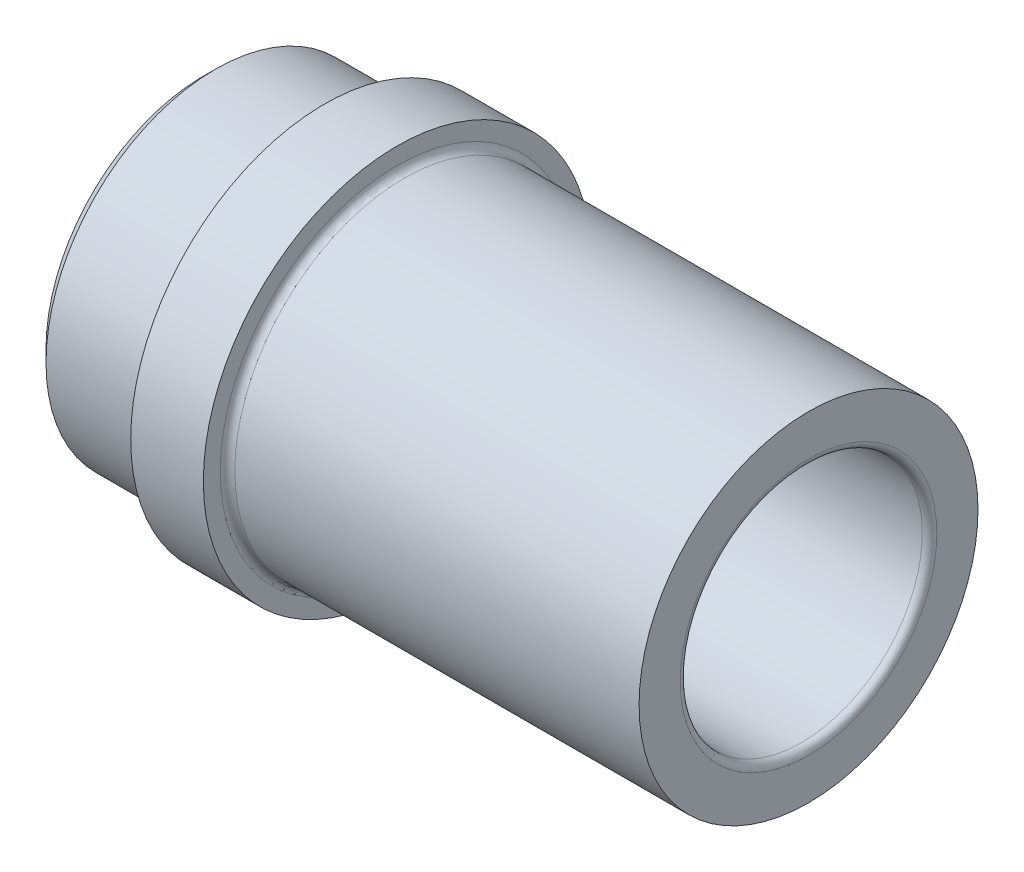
ISO-10303-21;
HEADER;
FILE_DESCRIPTION(('STEP AP214'),'2;1');
FILE_NAME('part.step','',(''),(''),'','','');
FILE_SCHEMA(('AUTOMOTIVE_DESIGN { 1 0 10303 214 1 1 1 1 }'));
ENDSEC;
DATA;
#1=APPLICATION_CONTEXT('core data for automotive mechanical design processes');
#2=APPLICATION_PROTOCOL_DEFINITION('international standard','automotive_design',2000,#1);
#3=PRODUCT_CONTEXT('',#1,'mechanical');
#4=PRODUCT('Part','Part','',(#3));
#5=PRODUCT_RELATED_PRODUCT_CATEGORY('part','',(#4));
#6=PRODUCT_DEFINITION_FORMATION('','',#4);
#7=PRODUCT_DEFINITION_CONTEXT('part definition',#1,'design');
#8=PRODUCT_DEFINITION('design','',#6,#7);
#9=PRODUCT_DEFINITION_SHAPE('','',#8);
#10=(LENGTH_UNIT() NAMED_UNIT(*) SI_UNIT(.MILLI.,.METRE.));
#11=(NAMED_UNIT(*) PLANE_ANGLE_UNIT() SI_UNIT($,.RADIAN.));
#12=(NAMED_UNIT(*) SI_UNIT($,.STERADIAN.) SOLID_ANGLE_UNIT());
#13=UNCERTAINTY_MEASURE_WITH_UNIT(LENGTH_MEASURE(1.E-05),#10,'distance_accuracy_value','');
#14=(GEOMETRIC_REPRESENTATION_CONTEXT(3) GLOBAL_UNCERTAINTY_ASSIGNED_CONTEXT((#13)) GLOBAL_UNIT_ASSIGNED_CONTEXT((#10,
#11,#12)) REPRESENTATION_CONTEXT('',''));
#15=CARTESIAN_POINT('',(0.,0.,0.));
#16=DIRECTION('',(0.,0.,1.));
#17=DIRECTION('',(1.,0.,0.));
#18=AXIS2_PLACEMENT_3D('',#15,#16,#17);
#19=CARTESIAN_POINT('',(0.,10.35,0.));
#20=DIRECTION('',(1.,0.,0.));
#21=DIRECTION('',(0.,0.,-1.));
#22=AXIS2_PLACEMENT_3D('',#19,#20,#21);
#23=PLANE('',#22);
#24=CARTESIAN_POINT('',(0.,0.,0.));
#25=DIRECTION('',(-1.,0.,0.));
#26=DIRECTION('',(0.,0.,1.));
#27=AXIS2_PLACEMENT_3D('',#24,#25,#26);
#28=CIRCLE('',#27,10.);
#29=CARTESIAN_POINT('',(0.,0.,10.));
#30=VERTEX_POINT('',#29);
#31=EDGE_CURVE('E10',#30,#30,#28,.T.);
#32=ORIENTED_EDGE('',*,*,#31,.F.);
#33=EDGE_LOOP('',(#32));
#34=FACE_BOUND('',#33,.T.);
#35=CARTESIAN_POINT('',(0.,0.,0.));
#36=DIRECTION('',(-1.,0.,0.));
#37=DIRECTION('',(0.,0.,1.));
#38=AXIS2_PLACEMENT_3D('',#35,#36,#37);
#39=CIRCLE('',#38,10.35);
#40=CARTESIAN_POINT('',(0.,0.,10.35));
#41=VERTEX_POINT('',#40);
#42=EDGE_CURVE('E61',#41,#41,#39,.T.);
#43=ORIENTED_EDGE('',*,*,#42,.T.);
#44=EDGE_LOOP('',(#43));
#45=FACE_BOUND('',#44,.T.);
#46=ADVANCED_FACE('F15',(#34,#45),#23,.F.);
#47=CARTESIAN_POINT('',(0.,0.,0.));
#48=DIRECTION('',(-1.,0.,0.));
#49=DIRECTION('',(0.,0.,1.));
#50=AXIS2_PLACEMENT_3D('',#47,#48,#49);
#51=CYLINDRICAL_SURFACE('',#50,10.);
#52=CARTESIAN_POINT('',(39.4,0.,0.));
#53=DIRECTION('',(-1.,0.,0.));
#54=DIRECTION('',(0.,0.,1.));
#55=AXIS2_PLACEMENT_3D('',#52,#53,#54);
#56=CIRCLE('',#55,10.);
#57=CARTESIAN_POINT('',(39.4,0.,10.));
#58=VERTEX_POINT('',#57);
#59=EDGE_CURVE('E21',#58,#58,#56,.T.);
#60=ORIENTED_EDGE('',*,*,#59,.F.);
#61=EDGE_LOOP('',(#60));
#62=FACE_BOUND('',#61,.T.);
#63=ORIENTED_EDGE('',*,*,#31,.T.);
#64=EDGE_LOOP('',(#63));
#65=FACE_BOUND('',#64,.T.);
#66=ADVANCED_FACE('F128',(#62,#65),#51,.F.);
#67=CARTESIAN_POINT('',(39.4,0.,0.));
#68=DIRECTION('',(-1.,0.,0.));
#69=DIRECTION('',(0.,0.,1.));
#70=AXIS2_PLACEMENT_3D('',#67,#68,#69);
#71=TOROIDAL_SURFACE('',#70,10.6,0.6);
#72=CARTESIAN_POINT('',(40.,0.,0.));
#73=DIRECTION('',(-1.,0.,0.));
#74=DIRECTION('',(0.,0.,1.));
#75=AXIS2_PLACEMENT_3D('',#72,#73,#74);
#76=CIRCLE('',#75,10.6);
#77=CARTESIAN_POINT('',(40.,0.,10.6));
#78=VERTEX_POINT('',#77);
#79=EDGE_CURVE('E25',#78,#78,#76,.T.);
#80=ORIENTED_EDGE('',*,*,#79,.F.);
#81=EDGE_LOOP('',(#80));
#82=FACE_BOUND('',#81,.T.);
#83=ORIENTED_EDGE('',*,*,#59,.T.);
#84=EDGE_LOOP('',(#83));
#85=FACE_BOUND('',#84,.T.);
#86=ADVANCED_FACE('F135',(#82,#85),#71,.T.);
#87=CARTESIAN_POINT('',(40.,10.6,0.));
#88=DIRECTION('',(-1.,0.,0.));
#89=DIRECTION('',(0.,0.,1.));
#90=AXIS2_PLACEMENT_3D('',#87,#88,#89);
#91=PLANE('',#90);
#92=CARTESIAN_POINT('',(40.,0.,0.));
#93=DIRECTION('',(-1.,0.,0.));
#94=DIRECTION('',(0.,0.,1.));
#95=AXIS2_PLACEMENT_3D('',#92,#93,#94);
#96=CIRCLE('',#95,14.);
#97=CARTESIAN_POINT('',(40.,0.,14.));
#98=VERTEX_POINT('',#97);
#99=EDGE_CURVE('E29',#98,#98,#96,.T.);
#100=ORIENTED_EDGE('',*,*,#99,.F.);
#101=EDGE_LOOP('',(#100));
#102=FACE_BOUND('',#101,.T.);
#103=ORIENTED_EDGE('',*,*,#79,.T.);
#104=EDGE_LOOP('',(#103));
#105=FACE_BOUND('',#104,.T.);
#106=ADVANCED_FACE('F124',(#102,#105),#91,.F.);
#107=CARTESIAN_POINT('',(0.,0.,0.));
#108=DIRECTION('',(-1.,0.,0.));
#109=DIRECTION('',(0.,0.,1.));
#110=AXIS2_PLACEMENT_3D('',#107,#108,#109);
#111=CYLINDRICAL_SURFACE('',#110,14.);
#112=ORIENTED_EDGE('',*,*,#99,.T.);
#113=EDGE_LOOP('',(#112));
#114=FACE_BOUND('',#113,.T.);
#115=CARTESIAN_POINT('',(6.6,0.,0.));
#116=DIRECTION('',(-1.,0.,0.));
#117=DIRECTION('',(0.,0.,1.));
#118=AXIS2_PLACEMENT_3D('',#115,#116,#117);
#119=CIRCLE('',#118,14.);
#120=CARTESIAN_POINT('',(6.6,0.,14.));
#121=VERTEX_POINT('',#120);
#122=EDGE_CURVE('E34',#121,#121,#119,.T.);
#123=ORIENTED_EDGE('',*,*,#122,.F.);
#124=EDGE_LOOP('',(#123));
#125=FACE_BOUND('',#124,.T.);
#126=ADVANCED_FACE('F116',(#114,#125),#111,.T.);
#127=CARTESIAN_POINT('',(6.6,0.,0.));
#128=DIRECTION('',(-1.,0.,0.));
#129=DIRECTION('',(0.,0.,1.));
#130=AXIS2_PLACEMENT_3D('',#127,#128,#129);
#131=TOROIDAL_SURFACE('',#130,14.6,0.6);
#132=ORIENTED_EDGE('',*,*,#122,.T.);
#133=EDGE_LOOP('',(#132));
#134=FACE_BOUND('',#133,.T.);
#135=CARTESIAN_POINT('',(6.,0.,0.));
#136=DIRECTION('',(-1.,0.,0.));
#137=DIRECTION('',(0.,0.,1.));
#138=AXIS2_PLACEMENT_3D('',#135,#136,#137);
#139=CIRCLE('',#138,14.6);
#140=CARTESIAN_POINT('',(6.,0.,14.6));
#141=VERTEX_POINT('',#140);
#142=EDGE_CURVE('E37',#141,#141,#139,.T.);
#143=ORIENTED_EDGE('',*,*,#142,.F.);
#144=EDGE_LOOP('',(#143));
#145=FACE_BOUND('',#144,.T.);
#146=ADVANCED_FACE('F111',(#134,#145),#131,.F.);
#147=CARTESIAN_POINT('',(6.,14.6,0.));
#148=DIRECTION('',(-1.,0.,0.));
#149=DIRECTION('',(0.,0.,1.));
#150=AXIS2_PLACEMENT_3D('',#147,#148,#149);
#151=PLANE('',#150);
#152=CARTESIAN_POINT('',(6.,0.,0.));
#153=DIRECTION('',(-1.,0.,0.));
#154=DIRECTION('',(0.,0.,1.));
#155=AXIS2_PLACEMENT_3D('',#152,#153,#154);
#156=CIRCLE('',#155,16.);
#157=CARTESIAN_POINT('',(6.,0.,16.));
#158=VERTEX_POINT('',#157);
#159=EDGE_CURVE('E40',#158,#158,#156,.T.);
#160=ORIENTED_EDGE('',*,*,#159,.F.);
#161=EDGE_LOOP('',(#160));
#162=FACE_BOUND('',#161,.T.);
#163=ORIENTED_EDGE('',*,*,#142,.T.);
#164=EDGE_LOOP('',(#163));
#165=FACE_BOUND('',#164,.T.);
#166=ADVANCED_FACE('F105',(#162,#165),#151,.F.);
#167=CARTESIAN_POINT('',(0.,0.,0.));
#168=DIRECTION('',(-1.,0.,0.));
#169=DIRECTION('',(0.,0.,1.));
#170=AXIS2_PLACEMENT_3D('',#167,#168,#169);
#171=CYLINDRICAL_SURFACE('',#170,16.);
#172=CARTESIAN_POINT('',(0.,0.,0.));
#173=DIRECTION('',(-1.,0.,0.));
#174=DIRECTION('',(0.,0.,1.));
#175=AXIS2_PLACEMENT_3D('',#172,#173,#174);
#176=CIRCLE('',#175,16.);
#177=CARTESIAN_POINT('',(0.,0.,16.));
#178=VERTEX_POINT('',#177);
#179=EDGE_CURVE('E43',#178,#178,#176,.T.);
#180=ORIENTED_EDGE('',*,*,#179,.F.);
#181=EDGE_LOOP('',(#180));
#182=FACE_BOUND('',#181,.T.);
#183=ORIENTED_EDGE('',*,*,#159,.T.);
#184=EDGE_LOOP('',(#183));
#185=FACE_BOUND('',#184,.T.);
#186=ADVANCED_FACE('F99',(#182,#185),#171,.T.);
#187=CARTESIAN_POINT('',(0.,16.,0.));
#188=DIRECTION('',(1.,0.,0.));
#189=DIRECTION('',(0.,0.,-1.));
#190=AXIS2_PLACEMENT_3D('',#187,#188,#189);
#191=PLANE('',#190);
#192=CARTESIAN_POINT('',(0.,0.,0.));
#193=DIRECTION('',(-1.,0.,0.));
#194=DIRECTION('',(0.,0.,1.));
#195=AXIS2_PLACEMENT_3D('',#192,#193,#194);
#196=CIRCLE('',#195,14.);
#197=CARTESIAN_POINT('',(0.,0.,14.));
#198=VERTEX_POINT('',#197);
#199=EDGE_CURVE('E46',#198,#198,#196,.T.);
#200=ORIENTED_EDGE('',*,*,#199,.F.);
#201=EDGE_LOOP('',(#200));
#202=FACE_BOUND('',#201,.T.);
#203=ORIENTED_EDGE('',*,*,#179,.T.);
#204=EDGE_LOOP('',(#203));
#205=FACE_BOUND('',#204,.T.);
#206=ADVANCED_FACE('F93',(#202,#205),#191,.F.);
#207=CARTESIAN_POINT('',(0.,0.,0.));
#208=DIRECTION('',(-1.,0.,0.));
#209=DIRECTION('',(0.,0.,1.));
#210=AXIS2_PLACEMENT_3D('',#207,#208,#209);
#211=CYLINDRICAL_SURFACE('',#210,14.);
#212=CARTESIAN_POINT('',(-9.,0.,0.));
#213=DIRECTION('',(-1.,0.,0.));
#214=DIRECTION('',(0.,0.,1.));
#215=AXIS2_PLACEMENT_3D('',#212,#213,#214);
#216=CIRCLE('',#215,14.);
#217=CARTESIAN_POINT('',(-9.,0.,14.));
#218=VERTEX_POINT('',#217);
#219=EDGE_CURVE('E49',#218,#218,#216,.T.);
#220=ORIENTED_EDGE('',*,*,#219,.F.);
#221=EDGE_LOOP('',(#220));
#222=FACE_BOUND('',#221,.T.);
#223=ORIENTED_EDGE('',*,*,#199,.T.);
#224=EDGE_LOOP('',(#223));
#225=FACE_BOUND('',#224,.T.);
#226=ADVANCED_FACE('F87',(#222,#225),#211,.T.);
#227=CARTESIAN_POINT('',(-9.,0.,0.));
#228=DIRECTION('',(1.,0.,0.));
#229=DIRECTION('',(0.,0.,-1.));
#230=AXIS2_PLACEMENT_3D('',#227,#228,#229);
#231=CONICAL_SURFACE('',#230,14.,0.785398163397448);
#232=CARTESIAN_POINT('',(-10.,0.,0.));
#233=DIRECTION('',(-1.,0.,0.));
#234=DIRECTION('',(0.,0.,1.));
#235=AXIS2_PLACEMENT_3D('',#232,#233,#234);
#236=CIRCLE('',#235,13.);
#237=CARTESIAN_POINT('',(-10.,0.,13.));
#238=VERTEX_POINT('',#237);
#239=EDGE_CURVE('E52',#238,#238,#236,.T.);
#240=ORIENTED_EDGE('',*,*,#239,.F.);
#241=EDGE_LOOP('',(#240));
#242=FACE_BOUND('',#241,.T.);
#243=ORIENTED_EDGE('',*,*,#219,.T.);
#244=EDGE_LOOP('',(#243));
#245=FACE_BOUND('',#244,.T.);
#246=ADVANCED_FACE('F81',(#242,#245),#231,.T.);
#247=CARTESIAN_POINT('',(-10.,13.,0.));
#248=DIRECTION('',(1.,0.,0.));
#249=DIRECTION('',(0.,0.,-1.));
#250=AXIS2_PLACEMENT_3D('',#247,#248,#249);
#251=PLANE('',#250);
#252=CARTESIAN_POINT('',(-10.,0.,0.));
#253=DIRECTION('',(-1.,0.,0.));
#254=DIRECTION('',(0.,0.,1.));
#255=AXIS2_PLACEMENT_3D('',#252,#253,#254);
#256=CIRCLE('',#255,11.);
#257=CARTESIAN_POINT('',(-10.,0.,11.));
#258=VERTEX_POINT('',#257);
#259=EDGE_CURVE('E55',#258,#258,#256,.T.);
#260=ORIENTED_EDGE('',*,*,#259,.F.);
#261=EDGE_LOOP('',(#260));
#262=FACE_BOUND('',#261,.T.);
#263=ORIENTED_EDGE('',*,*,#239,.T.);
#264=EDGE_LOOP('',(#263));
#265=FACE_BOUND('',#264,.T.);
#266=ADVANCED_FACE('F75',(#262,#265),#251,.F.);
#267=CARTESIAN_POINT('',(-10.,0.,0.));
#268=DIRECTION('',(-1.,0.,0.));
#269=DIRECTION('',(0.,0.,1.));
#270=AXIS2_PLACEMENT_3D('',#267,#268,#269);
#271=CONICAL_SURFACE('',#270,11.,0.576375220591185);
#272=CARTESIAN_POINT('',(-9.,0.,0.));
#273=DIRECTION('',(-1.,0.,0.));
#274=DIRECTION('',(0.,0.,1.));
#275=AXIS2_PLACEMENT_3D('',#272,#273,#274);
#276=CIRCLE('',#275,10.35);
#277=CARTESIAN_POINT('',(-9.,0.,10.35));
#278=VERTEX_POINT('',#277);
#279=EDGE_CURVE('E58',#278,#278,#276,.T.);
#280=ORIENTED_EDGE('',*,*,#279,.F.);
#281=EDGE_LOOP('',(#280));
#282=FACE_BOUND('',#281,.T.);
#283=ORIENTED_EDGE('',*,*,#259,.T.);
#284=EDGE_LOOP('',(#283));
#285=FACE_BOUND('',#284,.T.);
#286=ADVANCED_FACE('F69',(#282,#285),#271,.F.);
#287=CARTESIAN_POINT('',(0.,0.,0.));
#288=DIRECTION('',(-1.,0.,0.));
#289=DIRECTION('',(0.,0.,1.));
#290=AXIS2_PLACEMENT_3D('',#287,#288,#289);
#291=CYLINDRICAL_SURFACE('',#290,10.35);
#292=ORIENTED_EDGE('',*,*,#42,.F.);
#293=EDGE_LOOP('',(#292));
#294=FACE_BOUND('',#293,.T.);
#295=ORIENTED_EDGE('',*,*,#279,.T.);
#296=EDGE_LOOP('',(#295));
#297=FACE_BOUND('',#296,.T.);
#298=ADVANCED_FACE('F66',(#294,#297),#291,.F.);
#299=CLOSED_SHELL('',(#46,#66,#86,#106,#126,#146,#166,#186,#206,#226,#246,#266,#286,#298));
#300=MANIFOLD_SOLID_BREP('B1',#299);
#301=ADVANCED_BREP_SHAPE_REPRESENTATION('',(#18,#300),#14);
#302=SHAPE_DEFINITION_REPRESENTATION(#9,#301);
ENDSEC;
END-ISO-10303-21;
